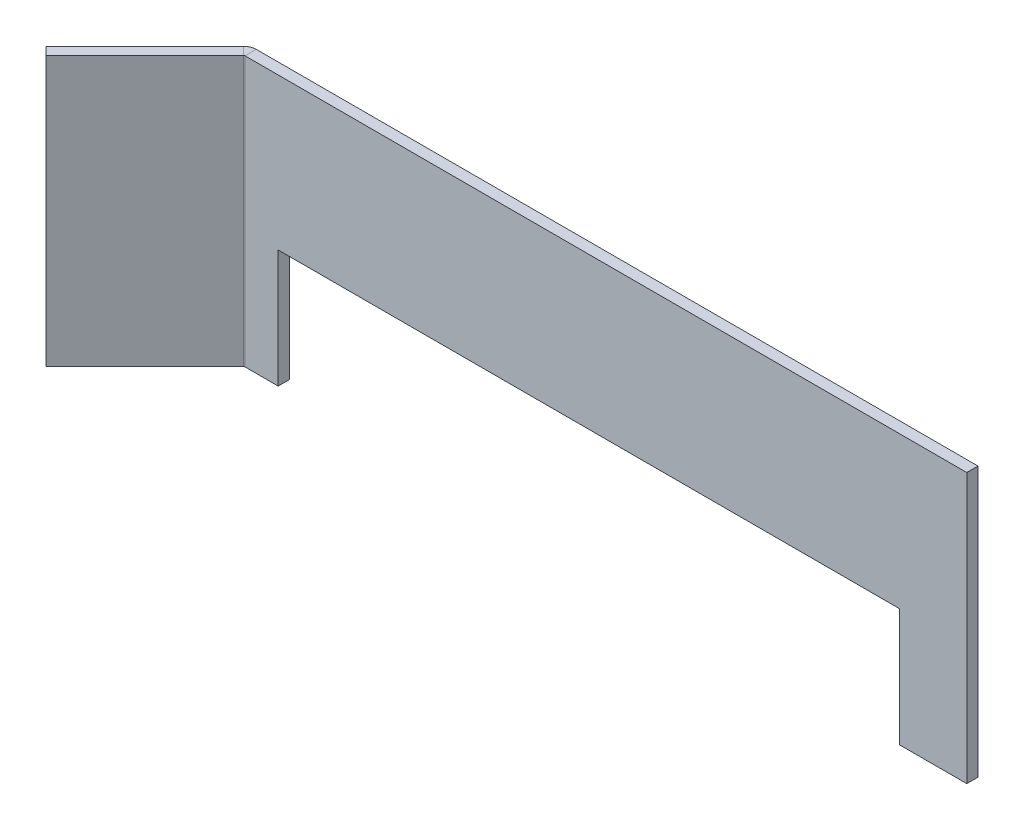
ISO-10303-21;
HEADER;
FILE_DESCRIPTION(('STEP AP214'),'2;1');
FILE_NAME('part.step','',(''),(''),'','','');
FILE_SCHEMA(('AUTOMOTIVE_DESIGN { 1 0 10303 214 1 1 1 1 }'));
ENDSEC;
DATA;
#1=APPLICATION_CONTEXT('core data for automotive mechanical design processes');
#2=APPLICATION_PROTOCOL_DEFINITION('international standard','automotive_design',2000,#1);
#3=PRODUCT_CONTEXT('',#1,'mechanical');
#4=PRODUCT('Part','Part','',(#3));
#5=PRODUCT_RELATED_PRODUCT_CATEGORY('part','',(#4));
#6=PRODUCT_DEFINITION_FORMATION('','',#4);
#7=PRODUCT_DEFINITION_CONTEXT('part definition',#1,'design');
#8=PRODUCT_DEFINITION('design','',#6,#7);
#9=PRODUCT_DEFINITION_SHAPE('','',#8);
#10=(LENGTH_UNIT() NAMED_UNIT(*) SI_UNIT(.MILLI.,.METRE.));
#11=(NAMED_UNIT(*) PLANE_ANGLE_UNIT() SI_UNIT($,.RADIAN.));
#12=(NAMED_UNIT(*) SI_UNIT($,.STERADIAN.) SOLID_ANGLE_UNIT());
#13=UNCERTAINTY_MEASURE_WITH_UNIT(LENGTH_MEASURE(1.E-05),#10,'distance_accuracy_value','');
#14=(GEOMETRIC_REPRESENTATION_CONTEXT(3) GLOBAL_UNCERTAINTY_ASSIGNED_CONTEXT((#13)) GLOBAL_UNIT_ASSIGNED_CONTEXT((#10,
#11,#12)) REPRESENTATION_CONTEXT('',''));
#15=CARTESIAN_POINT('',(0.,0.,0.));
#16=DIRECTION('',(0.,0.,1.));
#17=DIRECTION('',(1.,0.,0.));
#18=AXIS2_PLACEMENT_3D('',#15,#16,#17);
#19=CARTESIAN_POINT('',(0.,0.,6.));
#20=DIRECTION('',(0.,1.,0.));
#21=DIRECTION('',(0.,0.,1.));
#22=AXIS2_PLACEMENT_3D('',#19,#20,#21);
#23=PLANE('',#22);
#24=DIRECTION('',(1.,0.,0.));
#25=VECTOR('',#24,1.);
#26=CARTESIAN_POINT('',(0.,0.,6.));
#27=LINE('',#26,#25);
#28=CARTESIAN_POINT('',(350.,0.,6.));
#29=VERTEX_POINT('',#28);
#30=CARTESIAN_POINT('',(386.,0.,6.));
#31=VERTEX_POINT('',#30);
#32=EDGE_CURVE('E149',#29,#31,#27,.T.);
#33=ORIENTED_EDGE('',*,*,#32,.F.);
#34=DIRECTION('',(0.,0.,-1.));
#35=VECTOR('',#34,1.);
#36=CARTESIAN_POINT('',(350.,0.,10.));
#37=LINE('',#36,#35);
#38=CARTESIAN_POINT('',(350.,0.,0.));
#39=VERTEX_POINT('',#38);
#40=EDGE_CURVE('E135',#29,#39,#37,.T.);
#41=ORIENTED_EDGE('',*,*,#40,.T.);
#42=DIRECTION('',(1.,0.,0.));
#43=VECTOR('',#42,1.);
#44=CARTESIAN_POINT('',(0.,0.,0.));
#45=LINE('',#44,#43);
#46=CARTESIAN_POINT('',(386.,0.,0.));
#47=VERTEX_POINT('',#46);
#48=EDGE_CURVE('E148',#39,#47,#45,.T.);
#49=ORIENTED_EDGE('',*,*,#48,.T.);
#50=DIRECTION('',(0.,0.,-1.));
#51=VECTOR('',#50,1.);
#52=CARTESIAN_POINT('',(386.,0.,6.));
#53=LINE('',#52,#51);
#54=EDGE_CURVE('E11',#31,#47,#53,.T.);
#55=ORIENTED_EDGE('',*,*,#54,.F.);
#56=EDGE_LOOP('',(#33,#41,#49,#55));
#57=FACE_BOUND('',#56,.T.);
#58=ADVANCED_FACE('F43',(#57),#23,.F.);
#59=CARTESIAN_POINT('',(0.305109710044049,0.,0.));
#60=VERTEX_POINT('',#59);
#61=CARTESIAN_POINT('',(18.,0.,0.));
#62=VERTEX_POINT('',#61);
#63=EDGE_CURVE('E156',#60,#62,#45,.T.);
#64=ORIENTED_EDGE('',*,*,#63,.T.);
#65=DIRECTION('',(0.,0.,-1.));
#66=VECTOR('',#65,1.);
#67=CARTESIAN_POINT('',(18.,0.,10.));
#68=LINE('',#67,#66);
#69=CARTESIAN_POINT('',(18.,0.,6.));
#70=VERTEX_POINT('',#69);
#71=EDGE_CURVE('E58',#70,#62,#68,.T.);
#72=ORIENTED_EDGE('',*,*,#71,.F.);
#73=CARTESIAN_POINT('',(0.305109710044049,0.,6.));
#74=VERTEX_POINT('',#73);
#75=EDGE_CURVE('E177',#74,#70,#27,.T.);
#76=ORIENTED_EDGE('',*,*,#75,.F.);
#77=DIRECTION('',(0.,0.,-1.));
#78=VECTOR('',#77,1.);
#79=CARTESIAN_POINT('',(0.305109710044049,0.,6.));
#80=LINE('',#79,#78);
#81=EDGE_CURVE('E160',#74,#60,#80,.T.);
#82=ORIENTED_EDGE('',*,*,#81,.T.);
#83=EDGE_LOOP('',(#64,#72,#76,#82));
#84=FACE_BOUND('',#83,.T.);
#85=ADVANCED_FACE('F45',(#84),#23,.F.);
#86=CARTESIAN_POINT('',(0.,144.,6.));
#87=DIRECTION('',(0.,-1.,0.));
#88=DIRECTION('',(0.,0.,-1.));
#89=AXIS2_PLACEMENT_3D('',#86,#87,#88);
#90=PLANE('',#89);
#91=DIRECTION('',(0.,0.,-1.));
#92=VECTOR('',#91,1.);
#93=CARTESIAN_POINT('',(0.305109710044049,144.,6.));
#94=LINE('',#93,#92);
#95=CARTESIAN_POINT('',(0.305109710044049,144.,6.));
#96=VERTEX_POINT('',#95);
#97=CARTESIAN_POINT('',(0.305109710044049,144.,0.));
#98=VERTEX_POINT('',#97);
#99=EDGE_CURVE('E157',#96,#98,#94,.T.);
#100=ORIENTED_EDGE('',*,*,#99,.F.);
#101=DIRECTION('',(-1.,0.,0.));
#102=VECTOR('',#101,1.);
#103=CARTESIAN_POINT('',(0.,144.,6.));
#104=LINE('',#103,#102);
#105=CARTESIAN_POINT('',(386.,144.,6.));
#106=VERTEX_POINT('',#105);
#107=EDGE_CURVE('E164',#106,#96,#104,.T.);
#108=ORIENTED_EDGE('',*,*,#107,.F.);
#109=DIRECTION('',(0.,0.,-1.));
#110=VECTOR('',#109,1.);
#111=CARTESIAN_POINT('',(386.,144.,6.));
#112=LINE('',#111,#110);
#113=CARTESIAN_POINT('',(386.,144.,0.));
#114=VERTEX_POINT('',#113);
#115=EDGE_CURVE('E51',#106,#114,#112,.T.);
#116=ORIENTED_EDGE('',*,*,#115,.T.);
#117=DIRECTION('',(-1.,0.,0.));
#118=VECTOR('',#117,1.);
#119=CARTESIAN_POINT('',(0.,144.,0.));
#120=LINE('',#119,#118);
#121=EDGE_CURVE('E167',#114,#98,#120,.T.);
#122=ORIENTED_EDGE('',*,*,#121,.T.);
#123=EDGE_LOOP('',(#100,#108,#116,#122));
#124=FACE_BOUND('',#123,.T.);
#125=ADVANCED_FACE('F251',(#124),#90,.F.);
#126=CARTESIAN_POINT('',(0.,144.,6.));
#127=DIRECTION('',(0.,0.,-1.));
#128=DIRECTION('',(-1.,0.,0.));
#129=AXIS2_PLACEMENT_3D('',#126,#127,#128);
#130=PLANE('',#129);
#131=DIRECTION('',(1.,0.,0.));
#132=VECTOR('',#131,1.);
#133=CARTESIAN_POINT('',(0.,63.,6.));
#134=LINE('',#133,#132);
#135=CARTESIAN_POINT('',(18.,63.,6.));
#136=VERTEX_POINT('',#135);
#137=CARTESIAN_POINT('',(350.,63.,6.));
#138=VERTEX_POINT('',#137);
#139=EDGE_CURVE('E231',#136,#138,#134,.T.);
#140=ORIENTED_EDGE('',*,*,#139,.T.);
#141=DIRECTION('',(0.,-1.,0.));
#142=VECTOR('',#141,1.);
#143=CARTESIAN_POINT('',(350.,144.,6.));
#144=LINE('',#143,#142);
#145=EDGE_CURVE('E226',#138,#29,#144,.T.);
#146=ORIENTED_EDGE('',*,*,#145,.T.);
#147=ORIENTED_EDGE('',*,*,#32,.T.);
#148=DIRECTION('',(0.,1.,0.));
#149=VECTOR('',#148,1.);
#150=CARTESIAN_POINT('',(386.,0.,6.));
#151=LINE('',#150,#149);
#152=EDGE_CURVE('E174',#31,#106,#151,.T.);
#153=ORIENTED_EDGE('',*,*,#152,.T.);
#154=ORIENTED_EDGE('',*,*,#107,.T.);
#155=DIRECTION('',(0.,-1.,0.));
#156=VECTOR('',#155,1.);
#157=CARTESIAN_POINT('',(0.305109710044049,0.,6.));
#158=LINE('',#157,#156);
#159=EDGE_CURVE('E187',#74,#96,#158,.F.);
#160=ORIENTED_EDGE('',*,*,#159,.F.);
#161=ORIENTED_EDGE('',*,*,#75,.T.);
#162=DIRECTION('',(0.,1.,0.));
#163=VECTOR('',#162,1.);
#164=CARTESIAN_POINT('',(18.,144.,6.));
#165=LINE('',#164,#163);
#166=EDGE_CURVE('E234',#70,#136,#165,.T.);
#167=ORIENTED_EDGE('',*,*,#166,.T.);
#168=EDGE_LOOP('',(#140,#146,#147,#153,#154,#160,#161,#167));
#169=FACE_BOUND('',#168,.T.);
#170=ADVANCED_FACE('F247',(#169),#130,.F.);
#171=CARTESIAN_POINT('',(0.,144.,0.));
#172=DIRECTION('',(0.,0.,-1.));
#173=DIRECTION('',(-1.,0.,0.));
#174=AXIS2_PLACEMENT_3D('',#171,#172,#173);
#175=PLANE('',#174);
#176=DIRECTION('',(0.,-1.,0.));
#177=VECTOR('',#176,1.);
#178=CARTESIAN_POINT('',(350.,0.,0.));
#179=LINE('',#178,#177);
#180=CARTESIAN_POINT('',(350.,63.,0.));
#181=VERTEX_POINT('',#180);
#182=EDGE_CURVE('E132',#181,#39,#179,.T.);
#183=ORIENTED_EDGE('',*,*,#182,.F.);
#184=DIRECTION('',(1.,0.,0.));
#185=VECTOR('',#184,1.);
#186=CARTESIAN_POINT('',(350.,63.,0.));
#187=LINE('',#186,#185);
#188=CARTESIAN_POINT('',(18.,63.,0.));
#189=VERTEX_POINT('',#188);
#190=EDGE_CURVE('E150',#189,#181,#187,.T.);
#191=ORIENTED_EDGE('',*,*,#190,.F.);
#192=DIRECTION('',(0.,1.,0.));
#193=VECTOR('',#192,1.);
#194=CARTESIAN_POINT('',(18.,0.,0.));
#195=LINE('',#194,#193);
#196=EDGE_CURVE('E143',#62,#189,#195,.T.);
#197=ORIENTED_EDGE('',*,*,#196,.F.);
#198=ORIENTED_EDGE('',*,*,#63,.F.);
#199=DIRECTION('',(0.,-1.,0.));
#200=VECTOR('',#199,1.);
#201=CARTESIAN_POINT('',(0.305109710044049,0.,0.));
#202=LINE('',#201,#200);
#203=EDGE_CURVE('E196',#60,#98,#202,.F.);
#204=ORIENTED_EDGE('',*,*,#203,.T.);
#205=ORIENTED_EDGE('',*,*,#121,.F.);
#206=DIRECTION('',(0.,1.,0.));
#207=VECTOR('',#206,1.);
#208=CARTESIAN_POINT('',(386.,0.,0.));
#209=LINE('',#208,#207);
#210=EDGE_CURVE('E155',#47,#114,#209,.T.);
#211=ORIENTED_EDGE('',*,*,#210,.F.);
#212=ORIENTED_EDGE('',*,*,#48,.F.);
#213=EDGE_LOOP('',(#183,#191,#197,#198,#204,#205,#211,#212));
#214=FACE_BOUND('',#213,.T.);
#215=ADVANCED_FACE('F153',(#214),#175,.T.);
#216=CARTESIAN_POINT('',(386.,0.,6.));
#217=DIRECTION('',(-1.,0.,0.));
#218=DIRECTION('',(0.,0.,1.));
#219=AXIS2_PLACEMENT_3D('',#216,#217,#218);
#220=PLANE('',#219);
#221=ORIENTED_EDGE('',*,*,#210,.T.);
#222=ORIENTED_EDGE('',*,*,#115,.F.);
#223=ORIENTED_EDGE('',*,*,#152,.F.);
#224=ORIENTED_EDGE('',*,*,#54,.T.);
#225=EDGE_LOOP('',(#221,#222,#223,#224));
#226=FACE_BOUND('',#225,.T.);
#227=ADVANCED_FACE('F292',(#226),#220,.F.);
#228=CARTESIAN_POINT('',(0.305109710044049,144.,6.7366));
#229=DIRECTION('',(0.,1.,0.));
#230=DIRECTION('',(0.,0.,1.));
#231=AXIS2_PLACEMENT_3D('',#228,#229,#230);
#232=PLANE('',#231);
#233=DIRECTION('',(-0.707106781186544,0.,-0.707106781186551));
#234=VECTOR('',#233,1.);
#235=CARTESIAN_POINT('',(-0.215745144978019,144.,6.21574514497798));
#236=LINE('',#235,#234);
#237=CARTESIAN_POINT('',(-0.215745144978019,144.,6.21574514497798));
#238=VERTEX_POINT('',#237);
#239=CARTESIAN_POINT('',(-4.45838583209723,144.,1.97310445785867));
#240=VERTEX_POINT('',#239);
#241=EDGE_CURVE('E222',#238,#240,#236,.T.);
#242=ORIENTED_EDGE('',*,*,#241,.F.);
#243=CARTESIAN_POINT('',(0.305109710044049,144.,6.7366));
#244=DIRECTION('',(0.,-1.,0.));
#245=DIRECTION('',(0.,0.,-1.));
#246=AXIS2_PLACEMENT_3D('',#243,#244,#245);
#247=CIRCLE('',#246,0.736599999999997);
#248=EDGE_CURVE('E190',#96,#238,#247,.F.);
#249=ORIENTED_EDGE('',*,*,#248,.F.);
#250=ORIENTED_EDGE('',*,*,#99,.T.);
#251=CARTESIAN_POINT('',(0.305109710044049,144.,6.7366));
#252=DIRECTION('',(0.,-1.,0.));
#253=DIRECTION('',(0.,0.,-1.));
#254=AXIS2_PLACEMENT_3D('',#251,#252,#253);
#255=CIRCLE('',#254,6.7366);
#256=EDGE_CURVE('E66',#98,#240,#255,.F.);
#257=ORIENTED_EDGE('',*,*,#256,.T.);
#258=EDGE_LOOP('',(#242,#249,#250,#257));
#259=FACE_BOUND('',#258,.T.);
#260=ADVANCED_FACE('F254',(#259),#232,.T.);
#261=CARTESIAN_POINT('',(0.305109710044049,0.,6.7366));
#262=DIRECTION('',(0.,1.,0.));
#263=DIRECTION('',(0.,0.,1.));
#264=AXIS2_PLACEMENT_3D('',#261,#262,#263);
#265=PLANE('',#264);
#266=CARTESIAN_POINT('',(0.305109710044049,0.,6.7366));
#267=DIRECTION('',(0.,-1.,0.));
#268=DIRECTION('',(0.,0.,-1.));
#269=AXIS2_PLACEMENT_3D('',#266,#267,#268);
#270=CIRCLE('',#269,0.736599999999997);
#271=CARTESIAN_POINT('',(-0.215745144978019,0.,6.21574514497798));
#272=VERTEX_POINT('',#271);
#273=EDGE_CURVE('E184',#272,#74,#270,.T.);
#274=ORIENTED_EDGE('',*,*,#273,.F.);
#275=DIRECTION('',(-0.707106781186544,0.,-0.707106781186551));
#276=VECTOR('',#275,1.);
#277=CARTESIAN_POINT('',(-0.215745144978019,0.,6.21574514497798));
#278=LINE('',#277,#276);
#279=CARTESIAN_POINT('',(-4.45838583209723,0.,1.97310445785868));
#280=VERTEX_POINT('',#279);
#281=EDGE_CURVE('E221',#272,#280,#278,.T.);
#282=ORIENTED_EDGE('',*,*,#281,.T.);
#283=CARTESIAN_POINT('',(0.305109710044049,0.,6.7366));
#284=DIRECTION('',(0.,-1.,0.));
#285=DIRECTION('',(0.,0.,-1.));
#286=AXIS2_PLACEMENT_3D('',#283,#284,#285);
#287=CIRCLE('',#286,6.7366);
#288=EDGE_CURVE('E193',#280,#60,#287,.T.);
#289=ORIENTED_EDGE('',*,*,#288,.T.);
#290=ORIENTED_EDGE('',*,*,#81,.F.);
#291=EDGE_LOOP('',(#274,#282,#289,#290));
#292=FACE_BOUND('',#291,.T.);
#293=ADVANCED_FACE('F278',(#292),#265,.F.);
#294=CARTESIAN_POINT('',(0.305109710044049,0.,6.7366));
#295=DIRECTION('',(0.,-1.,0.));
#296=DIRECTION('',(-0.707106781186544,0.,-0.707106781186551));
#297=AXIS2_PLACEMENT_3D('',#294,#295,#296);
#298=CYLINDRICAL_SURFACE('',#297,6.7366);
#299=ORIENTED_EDGE('',*,*,#203,.F.);
#300=ORIENTED_EDGE('',*,*,#288,.F.);
#301=DIRECTION('',(0.,1.,0.));
#302=VECTOR('',#301,1.);
#303=CARTESIAN_POINT('',(-4.45838583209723,144.,1.97310445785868));
#304=LINE('',#303,#302);
#305=EDGE_CURVE('E214',#280,#240,#304,.T.);
#306=ORIENTED_EDGE('',*,*,#305,.T.);
#307=ORIENTED_EDGE('',*,*,#256,.F.);
#308=EDGE_LOOP('',(#299,#300,#306,#307));
#309=FACE_BOUND('',#308,.T.);
#310=ADVANCED_FACE('F281',(#309),#298,.T.);
#311=CARTESIAN_POINT('',(0.305109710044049,0.,6.7366));
#312=DIRECTION('',(0.,-1.,0.));
#313=DIRECTION('',(-0.707106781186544,0.,-0.707106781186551));
#314=AXIS2_PLACEMENT_3D('',#311,#312,#313);
#315=CYLINDRICAL_SURFACE('',#314,0.736599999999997);
#316=ORIENTED_EDGE('',*,*,#159,.T.);
#317=ORIENTED_EDGE('',*,*,#248,.T.);
#318=DIRECTION('',(0.,-1.,0.));
#319=VECTOR('',#318,1.);
#320=CARTESIAN_POINT('',(-0.215745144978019,144.,6.21574514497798));
#321=LINE('',#320,#319);
#322=EDGE_CURVE('E225',#238,#272,#321,.T.);
#323=ORIENTED_EDGE('',*,*,#322,.T.);
#324=ORIENTED_EDGE('',*,*,#273,.T.);
#325=EDGE_LOOP('',(#316,#317,#323,#324));
#326=FACE_BOUND('',#325,.T.);
#327=ADVANCED_FACE('F257',(#326),#315,.F.);
#328=CARTESIAN_POINT('',(-4.24264068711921,144.,1.75735931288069));
#329=DIRECTION('',(0.,-1.,0.));
#330=DIRECTION('',(0.,0.,-1.));
#331=AXIS2_PLACEMENT_3D('',#328,#329,#330);
#332=PLANE('',#331);
#333=ORIENTED_EDGE('',*,*,#241,.T.);
#334=DIRECTION('',(0.707106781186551,0.,-0.707106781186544));
#335=VECTOR('',#334,1.);
#336=CARTESIAN_POINT('',(-4.24264068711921,144.,1.75735931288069));
#337=LINE('',#336,#335);
#338=CARTESIAN_POINT('',(-57.2756492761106,144.,54.7903679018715));
#339=VERTEX_POINT('',#338);
#340=EDGE_CURVE('E208',#339,#240,#337,.T.);
#341=ORIENTED_EDGE('',*,*,#340,.F.);
#342=DIRECTION('',(0.707106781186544,0.,0.707106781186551));
#343=VECTOR('',#342,1.);
#344=CARTESIAN_POINT('',(-57.2756492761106,144.,54.7903679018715));
#345=LINE('',#344,#343);
#346=CARTESIAN_POINT('',(-53.0330085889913,144.,59.0330085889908));
#347=VERTEX_POINT('',#346);
#348=EDGE_CURVE('E202',#339,#347,#345,.T.);
#349=ORIENTED_EDGE('',*,*,#348,.T.);
#350=DIRECTION('',(0.707106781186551,0.,-0.707106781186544));
#351=VECTOR('',#350,1.);
#352=CARTESIAN_POINT('',(0.,144.,6.));
#353=LINE('',#352,#351);
#354=EDGE_CURVE('E211',#347,#238,#353,.T.);
#355=ORIENTED_EDGE('',*,*,#354,.T.);
#356=EDGE_LOOP('',(#333,#341,#349,#355));
#357=FACE_BOUND('',#356,.T.);
#358=ADVANCED_FACE('F265',(#357),#332,.F.);
#359=CARTESIAN_POINT('',(-57.2756492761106,0.,54.7903679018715));
#360=DIRECTION('',(0.,1.,0.));
#361=DIRECTION('',(0.,0.,1.));
#362=AXIS2_PLACEMENT_3D('',#359,#360,#361);
#363=PLANE('',#362);
#364=ORIENTED_EDGE('',*,*,#281,.F.);
#365=DIRECTION('',(-0.707106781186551,0.,0.707106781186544));
#366=VECTOR('',#365,1.);
#367=CARTESIAN_POINT('',(-53.0330085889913,0.,59.0330085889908));
#368=LINE('',#367,#366);
#369=CARTESIAN_POINT('',(-53.0330085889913,0.,59.0330085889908));
#370=VERTEX_POINT('',#369);
#371=EDGE_CURVE('E209',#272,#370,#368,.T.);
#372=ORIENTED_EDGE('',*,*,#371,.T.);
#373=DIRECTION('',(0.707106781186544,0.,0.707106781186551));
#374=VECTOR('',#373,1.);
#375=CARTESIAN_POINT('',(-57.2756492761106,0.,54.7903679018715));
#376=LINE('',#375,#374);
#377=CARTESIAN_POINT('',(-57.2756492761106,0.,54.7903679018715));
#378=VERTEX_POINT('',#377);
#379=EDGE_CURVE('E188',#378,#370,#376,.T.);
#380=ORIENTED_EDGE('',*,*,#379,.F.);
#381=DIRECTION('',(-0.707106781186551,0.,0.707106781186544));
#382=VECTOR('',#381,1.);
#383=CARTESIAN_POINT('',(-57.2756492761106,0.,54.7903679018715));
#384=LINE('',#383,#382);
#385=EDGE_CURVE('E216',#280,#378,#384,.T.);
#386=ORIENTED_EDGE('',*,*,#385,.F.);
#387=EDGE_LOOP('',(#364,#372,#380,#386));
#388=FACE_BOUND('',#387,.T.);
#389=ADVANCED_FACE('F275',(#388),#363,.F.);
#390=CARTESIAN_POINT('',(-57.2756492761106,144.,54.7903679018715));
#391=DIRECTION('',(0.707106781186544,0.,0.707106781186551));
#392=DIRECTION('',(0.707106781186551,0.,-0.707106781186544));
#393=AXIS2_PLACEMENT_3D('',#390,#391,#392);
#394=PLANE('',#393);
#395=ORIENTED_EDGE('',*,*,#305,.F.);
#396=ORIENTED_EDGE('',*,*,#385,.T.);
#397=DIRECTION('',(0.,1.,0.));
#398=VECTOR('',#397,1.);
#399=CARTESIAN_POINT('',(-57.2756492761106,144.,54.7903679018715));
#400=LINE('',#399,#398);
#401=EDGE_CURVE('E205',#378,#339,#400,.T.);
#402=ORIENTED_EDGE('',*,*,#401,.T.);
#403=ORIENTED_EDGE('',*,*,#340,.T.);
#404=EDGE_LOOP('',(#395,#396,#402,#403));
#405=FACE_BOUND('',#404,.T.);
#406=ADVANCED_FACE('F280',(#405),#394,.F.);
#407=CARTESIAN_POINT('',(-53.0330085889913,144.,59.0330085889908));
#408=DIRECTION('',(0.707106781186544,0.,0.707106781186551));
#409=DIRECTION('',(0.707106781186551,0.,-0.707106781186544));
#410=AXIS2_PLACEMENT_3D('',#407,#408,#409);
#411=PLANE('',#410);
#412=ORIENTED_EDGE('',*,*,#371,.F.);
#413=ORIENTED_EDGE('',*,*,#322,.F.);
#414=ORIENTED_EDGE('',*,*,#354,.F.);
#415=DIRECTION('',(0.,1.,0.));
#416=VECTOR('',#415,1.);
#417=CARTESIAN_POINT('',(-53.0330085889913,144.,59.0330085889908));
#418=LINE('',#417,#416);
#419=EDGE_CURVE('E206',#370,#347,#418,.T.);
#420=ORIENTED_EDGE('',*,*,#419,.F.);
#421=EDGE_LOOP('',(#412,#413,#414,#420));
#422=FACE_BOUND('',#421,.T.);
#423=ADVANCED_FACE('F262',(#422),#411,.T.);
#424=CARTESIAN_POINT('',(-57.2756492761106,144.,54.7903679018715));
#425=DIRECTION('',(0.707106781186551,0.,-0.707106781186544));
#426=DIRECTION('',(-0.707106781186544,0.,-0.707106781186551));
#427=AXIS2_PLACEMENT_3D('',#424,#425,#426);
#428=PLANE('',#427);
#429=ORIENTED_EDGE('',*,*,#419,.T.);
#430=ORIENTED_EDGE('',*,*,#348,.F.);
#431=ORIENTED_EDGE('',*,*,#401,.F.);
#432=ORIENTED_EDGE('',*,*,#379,.T.);
#433=EDGE_LOOP('',(#429,#430,#431,#432));
#434=FACE_BOUND('',#433,.T.);
#435=ADVANCED_FACE('F270',(#434),#428,.F.);
#436=CARTESIAN_POINT('',(350.,0.,10.));
#437=DIRECTION('',(1.,0.,0.));
#438=DIRECTION('',(0.,1.,0.));
#439=AXIS2_PLACEMENT_3D('',#436,#437,#438);
#440=PLANE('',#439);
#441=DIRECTION('',(0.,0.,-1.));
#442=VECTOR('',#441,1.);
#443=CARTESIAN_POINT('',(350.,63.,10.));
#444=LINE('',#443,#442);
#445=EDGE_CURVE('E138',#138,#181,#444,.T.);
#446=ORIENTED_EDGE('',*,*,#445,.T.);
#447=ORIENTED_EDGE('',*,*,#182,.T.);
#448=ORIENTED_EDGE('',*,*,#40,.F.);
#449=ORIENTED_EDGE('',*,*,#145,.F.);
#450=EDGE_LOOP('',(#446,#447,#448,#449));
#451=FACE_BOUND('',#450,.T.);
#452=ADVANCED_FACE('F134',(#451),#440,.F.);
#453=CARTESIAN_POINT('',(350.,63.,10.));
#454=DIRECTION('',(0.,1.,0.));
#455=DIRECTION('',(0.,0.,1.));
#456=AXIS2_PLACEMENT_3D('',#453,#454,#455);
#457=PLANE('',#456);
#458=DIRECTION('',(0.,0.,-1.));
#459=VECTOR('',#458,1.);
#460=CARTESIAN_POINT('',(18.,63.,10.));
#461=LINE('',#460,#459);
#462=EDGE_CURVE('E238',#136,#189,#461,.T.);
#463=ORIENTED_EDGE('',*,*,#462,.T.);
#464=ORIENTED_EDGE('',*,*,#190,.T.);
#465=ORIENTED_EDGE('',*,*,#445,.F.);
#466=ORIENTED_EDGE('',*,*,#139,.F.);
#467=EDGE_LOOP('',(#463,#464,#465,#466));
#468=FACE_BOUND('',#467,.T.);
#469=ADVANCED_FACE('F246',(#468),#457,.F.);
#470=CARTESIAN_POINT('',(18.,0.,10.));
#471=DIRECTION('',(-1.,0.,0.));
#472=DIRECTION('',(0.,0.,1.));
#473=AXIS2_PLACEMENT_3D('',#470,#471,#472);
#474=PLANE('',#473);
#475=ORIENTED_EDGE('',*,*,#71,.T.);
#476=ORIENTED_EDGE('',*,*,#196,.T.);
#477=ORIENTED_EDGE('',*,*,#462,.F.);
#478=ORIENTED_EDGE('',*,*,#166,.F.);
#479=EDGE_LOOP('',(#475,#476,#477,#478));
#480=FACE_BOUND('',#479,.T.);
#481=ADVANCED_FACE('F243',(#480),#474,.F.);
#482=CLOSED_SHELL('',(#58,#85,#125,#170,#215,#227,#260,#293,#310,#327,#358,#389,#406,#423,#435,
#452,#469,#481));
#483=MANIFOLD_SOLID_BREP('B2',#482);
#484=ADVANCED_BREP_SHAPE_REPRESENTATION('',(#18,#483),#14);
#485=SHAPE_DEFINITION_REPRESENTATION(#9,#484);
ENDSEC;
END-ISO-10303-21;
